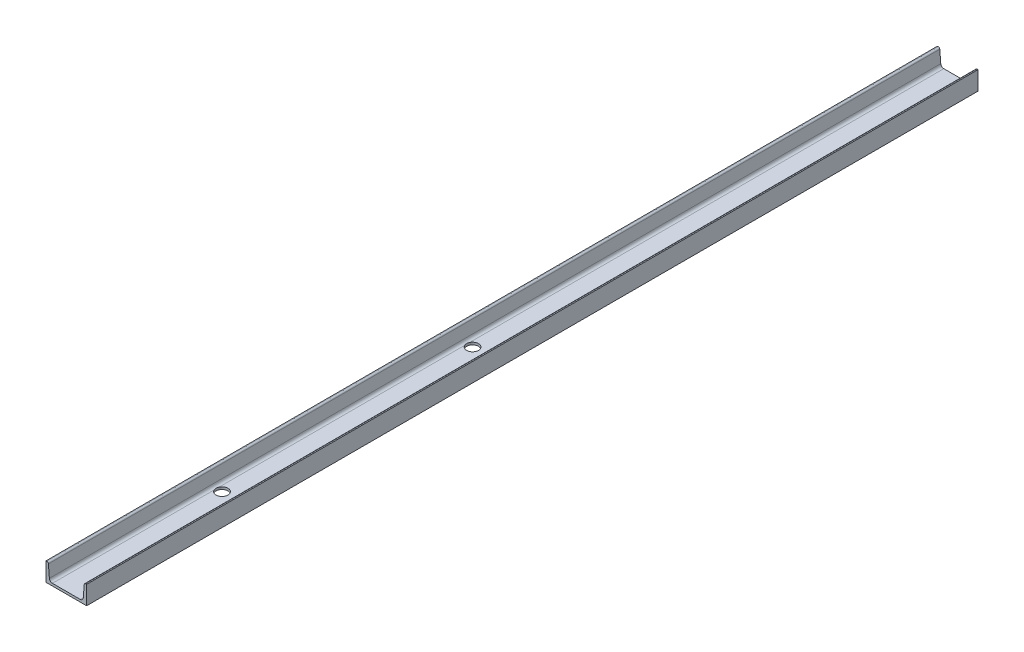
from build123d import *

# Parameters (mm, degrees)
BOSS_EXTRU_1_DEPTH           = 2633
ENL_V_MAT_EXTRU_1_DEPTH      = 1319.740402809
ENL_V_MAT_EXTRU_1_DEPTH_BACK = 1319.740402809
ESQUISSE2_R                  = 17.5


with BuildPart() as part:
    # Esquisse1 → Boss.-Extru.1 (new body)
    with BuildSketch(Plane.XY.offset(1316.5)):
        with BuildLine():
            Line((41.051245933, 7), (-41.051245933, 7))
            ThreePointArc((-41.051245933, 7), (-47.15618807, 9.387157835), (-50.02258344, 15.282292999))
            Line((-50.02258344, 15.282292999), (-52.86870828, 50.8588535))
            ThreePointArc((-52.86870828, 50.8588535), (-54.301905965, 53.806421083), (-57.354377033, 55))
            Line((-57.354377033, 55), (-60, 55))
            Line((-60, 55), (-60, 0))
            Line((-60, 0), (60, 0))
            Line((60, 0), (60, 55))
            Line((60, 55), (57.354377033, 55))
            ThreePointArc((57.354377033, 55), (54.301905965, 53.806421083), (52.86870828, 50.8588535))
            Line((52.86870828, 50.8588535), (50.02258344, 15.282292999))
            ThreePointArc((50.02258344, 15.282292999), (47.15618807, 9.387157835), (41.051245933, 7))
        make_face()
    extrude(amount=-BOSS_EXTRU_1_DEPTH)

    # Esquisse2 → Enl_v. mat.-Extru.1 (cut, two sides: drawn at the far end of the back side and taken through both)
    with BuildSketch(Plane(origin=(0, 7, 0), x_dir=(1, 0, 0), z_dir=(0, 1, 0)).offset(-ENL_V_MAT_EXTRU_1_DEPTH_BACK)):
        with Locations(Location((-25, -831.5, 0), (0, 0, 270))):
            Circle(ESQUISSE2_R)
        with Locations(Location((-25, -91.5, 0), (0, 0, 270))):
            Circle(ESQUISSE2_R)
    extrude(amount=ENL_V_MAT_EXTRU_1_DEPTH + ENL_V_MAT_EXTRU_1_DEPTH_BACK, mode=Mode.SUBTRACT)


solid = part.part
